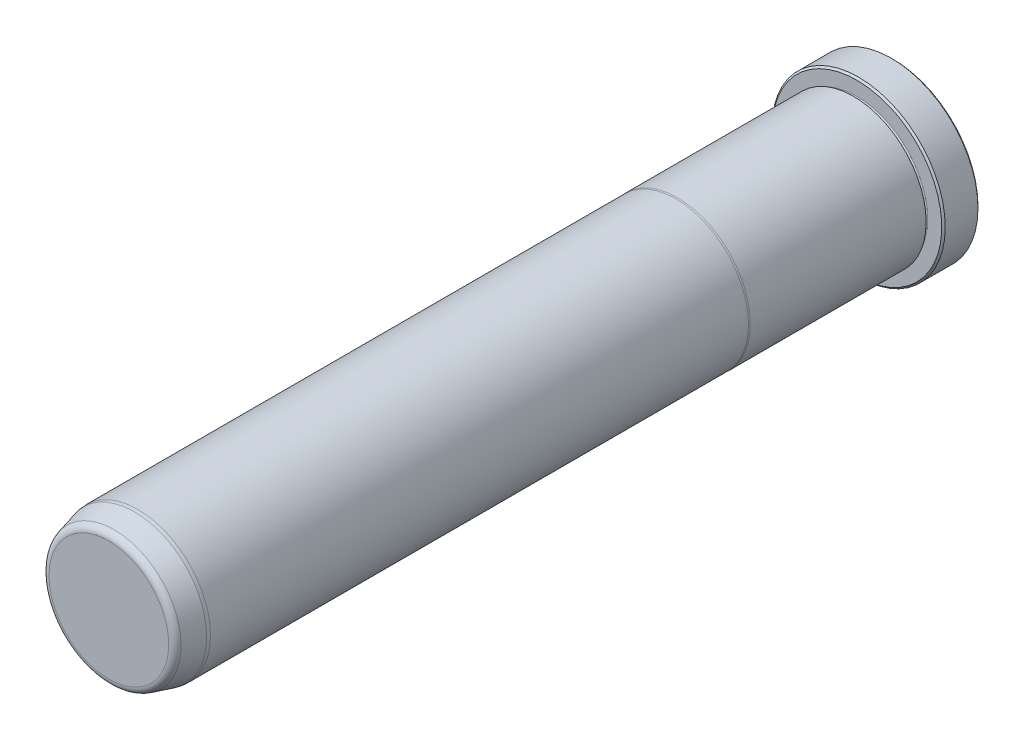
ISO-10303-21;
HEADER;
FILE_DESCRIPTION(('STEP AP214'),'2;1');
FILE_NAME('part.step','',(''),(''),'','','');
FILE_SCHEMA(('AUTOMOTIVE_DESIGN { 1 0 10303 214 1 1 1 1 }'));
ENDSEC;
DATA;
#1=APPLICATION_CONTEXT('core data for automotive mechanical design processes');
#2=APPLICATION_PROTOCOL_DEFINITION('international standard','automotive_design',2000,#1);
#3=PRODUCT_CONTEXT('',#1,'mechanical');
#4=PRODUCT('Part','Part','',(#3));
#5=PRODUCT_RELATED_PRODUCT_CATEGORY('part','',(#4));
#6=PRODUCT_DEFINITION_FORMATION('','',#4);
#7=PRODUCT_DEFINITION_CONTEXT('part definition',#1,'design');
#8=PRODUCT_DEFINITION('design','',#6,#7);
#9=PRODUCT_DEFINITION_SHAPE('','',#8);
#10=(LENGTH_UNIT() NAMED_UNIT(*) SI_UNIT(.MILLI.,.METRE.));
#11=(NAMED_UNIT(*) PLANE_ANGLE_UNIT() SI_UNIT($,.RADIAN.));
#12=(NAMED_UNIT(*) SI_UNIT($,.STERADIAN.) SOLID_ANGLE_UNIT());
#13=UNCERTAINTY_MEASURE_WITH_UNIT(LENGTH_MEASURE(1.E-05),#10,'distance_accuracy_value','');
#14=(GEOMETRIC_REPRESENTATION_CONTEXT(3) GLOBAL_UNCERTAINTY_ASSIGNED_CONTEXT((#13)) GLOBAL_UNIT_ASSIGNED_CONTEXT((#10,
#11,#12)) REPRESENTATION_CONTEXT('',''));
#15=CARTESIAN_POINT('',(0.,0.,0.));
#16=DIRECTION('',(0.,0.,1.));
#17=DIRECTION('',(1.,0.,0.));
#18=AXIS2_PLACEMENT_3D('',#15,#16,#17);
#19=CARTESIAN_POINT('',(0.,0.,0.));
#20=DIRECTION('',(0.,0.,1.));
#21=DIRECTION('',(1.,0.,0.));
#22=AXIS2_PLACEMENT_3D('',#19,#20,#21);
#23=PLANE('',#22);
#24=CARTESIAN_POINT('',(0.,0.,0.));
#25=DIRECTION('',(0.,0.,1.));
#26=DIRECTION('',(1.,0.,0.));
#27=AXIS2_PLACEMENT_3D('',#24,#25,#26);
#28=CIRCLE('',#27,18.542);
#29=CARTESIAN_POINT('',(18.542,0.,0.));
#30=VERTEX_POINT('',#29);
#31=EDGE_CURVE('E37',#30,#30,#28,.F.);
#32=ORIENTED_EDGE('',*,*,#31,.T.);
#33=EDGE_LOOP('',(#32));
#34=FACE_BOUND('',#33,.T.);
#35=ADVANCED_FACE('F30',(#34),#23,.F.);
#36=CARTESIAN_POINT('',(0.,0.,0.));
#37=DIRECTION('',(0.,0.,1.));
#38=DIRECTION('',(1.,0.,0.));
#39=AXIS2_PLACEMENT_3D('',#36,#37,#38);
#40=CYLINDRICAL_SURFACE('',#39,18.923);
#41=CARTESIAN_POINT('',(0.,0.,0.380999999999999));
#42=DIRECTION('',(0.,0.,1.));
#43=DIRECTION('',(1.,0.,0.));
#44=AXIS2_PLACEMENT_3D('',#41,#42,#43);
#45=CIRCLE('',#44,18.923);
#46=CARTESIAN_POINT('',(18.923,0.,0.380999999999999));
#47=VERTEX_POINT('',#46);
#48=EDGE_CURVE('E41',#47,#47,#45,.T.);
#49=ORIENTED_EDGE('',*,*,#48,.T.);
#50=EDGE_LOOP('',(#49));
#51=FACE_BOUND('',#50,.T.);
#52=CARTESIAN_POINT('',(0.,0.,7.54380000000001));
#53=DIRECTION('',(0.,0.,-1.));
#54=DIRECTION('',(-1.,0.,0.));
#55=AXIS2_PLACEMENT_3D('',#52,#53,#54);
#56=CIRCLE('',#55,18.923);
#57=CARTESIAN_POINT('',(-18.923,0.,7.54380000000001));
#58=VERTEX_POINT('',#57);
#59=EDGE_CURVE('E45',#58,#58,#56,.T.);
#60=ORIENTED_EDGE('',*,*,#59,.T.);
#61=EDGE_LOOP('',(#60));
#62=FACE_BOUND('',#61,.T.);
#63=ADVANCED_FACE('F118',(#51,#62),#40,.T.);
#64=CARTESIAN_POINT('',(0.,18.923,7.9248));
#65=DIRECTION('',(0.,0.,-1.));
#66=DIRECTION('',(-1.,0.,0.));
#67=AXIS2_PLACEMENT_3D('',#64,#65,#66);
#68=PLANE('',#67);
#69=CARTESIAN_POINT('',(0.,0.,7.9248));
#70=DIRECTION('',(0.,0.,-1.));
#71=DIRECTION('',(-1.,0.,0.));
#72=AXIS2_PLACEMENT_3D('',#69,#70,#71);
#73=CIRCLE('',#72,18.542);
#74=CARTESIAN_POINT('',(-18.542,0.,7.9248));
#75=VERTEX_POINT('',#74);
#76=EDGE_CURVE('E10',#75,#75,#73,.F.);
#77=ORIENTED_EDGE('',*,*,#76,.T.);
#78=EDGE_LOOP('',(#77));
#79=FACE_BOUND('',#78,.T.);
#80=CARTESIAN_POINT('',(0.,0.,7.9248));
#81=DIRECTION('',(0.,0.,1.));
#82=DIRECTION('',(1.,0.,0.));
#83=AXIS2_PLACEMENT_3D('',#80,#81,#82);
#84=CIRCLE('',#83,15.4813);
#85=CARTESIAN_POINT('',(15.4813,0.,7.9248));
#86=VERTEX_POINT('',#85);
#87=EDGE_CURVE('E56',#86,#86,#84,.T.);
#88=ORIENTED_EDGE('',*,*,#87,.F.);
#89=EDGE_LOOP('',(#88));
#90=FACE_BOUND('',#89,.T.);
#91=ADVANCED_FACE('F113',(#79,#90),#68,.F.);
#92=CARTESIAN_POINT('',(0.,0.,8.3058));
#93=DIRECTION('',(0.,0.,1.));
#94=DIRECTION('',(1.,0.,0.));
#95=AXIS2_PLACEMENT_3D('',#92,#93,#94);
#96=TOROIDAL_SURFACE('',#95,15.4813,0.381000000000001);
#97=CARTESIAN_POINT('',(0.,0.,8.6868));
#98=DIRECTION('',(0.,0.,1.));
#99=DIRECTION('',(1.,0.,0.));
#100=AXIS2_PLACEMENT_3D('',#97,#98,#99);
#101=CIRCLE('',#100,15.4813);
#102=CARTESIAN_POINT('',(15.4813,0.,8.6868));
#103=VERTEX_POINT('',#102);
#104=EDGE_CURVE('E59',#103,#103,#101,.T.);
#105=ORIENTED_EDGE('',*,*,#104,.F.);
#106=EDGE_LOOP('',(#105));
#107=FACE_BOUND('',#106,.T.);
#108=ORIENTED_EDGE('',*,*,#87,.T.);
#109=EDGE_LOOP('',(#108));
#110=FACE_BOUND('',#109,.T.);
#111=ADVANCED_FACE('F107',(#107,#110),#96,.F.);
#112=CARTESIAN_POINT('',(0.,15.4813,8.6868));
#113=DIRECTION('',(0.,0.,1.));
#114=DIRECTION('',(1.,0.,0.));
#115=AXIS2_PLACEMENT_3D('',#112,#113,#114);
#116=PLANE('',#115);
#117=CARTESIAN_POINT('',(0.,0.,8.6868));
#118=DIRECTION('',(0.,0.,1.));
#119=DIRECTION('',(1.,0.,0.));
#120=AXIS2_PLACEMENT_3D('',#117,#118,#119);
#121=CIRCLE('',#120,15.8877);
#122=CARTESIAN_POINT('',(15.8877,0.,8.6868));
#123=VERTEX_POINT('',#122);
#124=EDGE_CURVE('E62',#123,#123,#121,.T.);
#125=ORIENTED_EDGE('',*,*,#124,.F.);
#126=EDGE_LOOP('',(#125));
#127=FACE_BOUND('',#126,.T.);
#128=ORIENTED_EDGE('',*,*,#104,.T.);
#129=EDGE_LOOP('',(#128));
#130=FACE_BOUND('',#129,.T.);
#131=ADVANCED_FACE('F101',(#127,#130),#116,.F.);
#132=CARTESIAN_POINT('',(0.,0.,0.));
#133=DIRECTION('',(0.,0.,1.));
#134=DIRECTION('',(1.,0.,0.));
#135=AXIS2_PLACEMENT_3D('',#132,#133,#134);
#136=CYLINDRICAL_SURFACE('',#135,15.8877);
#137=CARTESIAN_POINT('',(0.,0.,47.1347630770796));
#138=DIRECTION('',(0.,0.,1.));
#139=DIRECTION('',(1.,0.,0.));
#140=AXIS2_PLACEMENT_3D('',#137,#138,#139);
#141=CIRCLE('',#140,15.8877);
#142=CARTESIAN_POINT('',(15.8877,0.,47.1347630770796));
#143=VERTEX_POINT('',#142);
#144=EDGE_CURVE('E65',#143,#143,#141,.T.);
#145=ORIENTED_EDGE('',*,*,#144,.F.);
#146=EDGE_LOOP('',(#145));
#147=FACE_BOUND('',#146,.T.);
#148=ORIENTED_EDGE('',*,*,#124,.T.);
#149=EDGE_LOOP('',(#148));
#150=FACE_BOUND('',#149,.T.);
#151=ADVANCED_FACE('F95',(#147,#150),#136,.T.);
#152=CARTESIAN_POINT('',(0.,0.,47.1347630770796));
#153=DIRECTION('',(0.,0.,-1.));
#154=DIRECTION('',(-1.,0.,0.));
#155=AXIS2_PLACEMENT_3D('',#152,#153,#154);
#156=CONICAL_SURFACE('',#155,15.8877,0.0698131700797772);
#157=CARTESIAN_POINT('',(0.,0.,47.498));
#158=DIRECTION('',(0.,0.,1.));
#159=DIRECTION('',(1.,0.,0.));
#160=AXIS2_PLACEMENT_3D('',#157,#158,#159);
#161=CIRCLE('',#160,15.8623);
#162=CARTESIAN_POINT('',(15.8623,0.,47.498));
#163=VERTEX_POINT('',#162);
#164=EDGE_CURVE('E68',#163,#163,#161,.T.);
#165=ORIENTED_EDGE('',*,*,#164,.F.);
#166=EDGE_LOOP('',(#165));
#167=FACE_BOUND('',#166,.T.);
#168=ORIENTED_EDGE('',*,*,#144,.T.);
#169=EDGE_LOOP('',(#168));
#170=FACE_BOUND('',#169,.T.);
#171=ADVANCED_FACE('F89',(#167,#170),#156,.T.);
#172=CARTESIAN_POINT('',(0.,0.,0.));
#173=DIRECTION('',(0.,0.,1.));
#174=DIRECTION('',(1.,0.,0.));
#175=AXIS2_PLACEMENT_3D('',#172,#173,#174);
#176=CYLINDRICAL_SURFACE('',#175,15.8623);
#177=CARTESIAN_POINT('',(0.,0.,165.1));
#178=DIRECTION('',(0.,0.,1.));
#179=DIRECTION('',(1.,0.,0.));
#180=AXIS2_PLACEMENT_3D('',#177,#178,#179);
#181=CIRCLE('',#180,15.8623);
#182=CARTESIAN_POINT('',(15.8623,0.,165.1));
#183=VERTEX_POINT('',#182);
#184=EDGE_CURVE('E71',#183,#183,#181,.T.);
#185=ORIENTED_EDGE('',*,*,#184,.F.);
#186=EDGE_LOOP('',(#185));
#187=FACE_BOUND('',#186,.T.);
#188=ORIENTED_EDGE('',*,*,#164,.T.);
#189=EDGE_LOOP('',(#188));
#190=FACE_BOUND('',#189,.T.);
#191=ADVANCED_FACE('F83',(#187,#190),#176,.T.);
#192=CARTESIAN_POINT('',(0.,0.,165.1));
#193=DIRECTION('',(0.,0.,-1.));
#194=DIRECTION('',(-1.,0.,0.));
#195=AXIS2_PLACEMENT_3D('',#192,#193,#194);
#196=CONICAL_SURFACE('',#195,15.8623,0.0872664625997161);
#197=CARTESIAN_POINT('',(0.,0.,165.862));
#198=DIRECTION('',(0.,0.,1.));
#199=DIRECTION('',(1.,0.,0.));
#200=AXIS2_PLACEMENT_3D('',#197,#198,#199);
#201=CIRCLE('',#200,15.7956336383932);
#202=CARTESIAN_POINT('',(15.7956336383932,0.,165.862));
#203=VERTEX_POINT('',#202);
#204=EDGE_CURVE('E74',#203,#203,#201,.T.);
#205=ORIENTED_EDGE('',*,*,#204,.F.);
#206=EDGE_LOOP('',(#205));
#207=FACE_BOUND('',#206,.T.);
#208=ORIENTED_EDGE('',*,*,#184,.T.);
#209=EDGE_LOOP('',(#208));
#210=FACE_BOUND('',#209,.T.);
#211=ADVANCED_FACE('F80',(#207,#210),#196,.T.);
#212=CARTESIAN_POINT('',(0.,0.,165.862));
#213=DIRECTION('',(0.,0.,-1.));
#214=DIRECTION('',(-1.,0.,0.));
#215=AXIS2_PLACEMENT_3D('',#212,#213,#214);
#216=CONICAL_SURFACE('',#215,15.7956336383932,0.26179938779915);
#217=CARTESIAN_POINT('',(0.,0.,170.2733752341));
#218=DIRECTION('',(0.,0.,1.));
#219=DIRECTION('',(1.,0.,0.));
#220=AXIS2_PLACEMENT_3D('',#217,#218,#219);
#221=CIRCLE('',#220,14.6136092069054);
#222=CARTESIAN_POINT('',(14.6136092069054,0.,170.2733752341));
#223=VERTEX_POINT('',#222);
#224=EDGE_CURVE('E50',#223,#223,#221,.F.);
#225=ORIENTED_EDGE('',*,*,#224,.T.);
#226=EDGE_LOOP('',(#225));
#227=FACE_BOUND('',#226,.T.);
#228=ORIENTED_EDGE('',*,*,#204,.T.);
#229=EDGE_LOOP('',(#228));
#230=FACE_BOUND('',#229,.T.);
#231=ADVANCED_FACE('F78',(#227,#230),#216,.T.);
#232=CARTESIAN_POINT('',(0.,14.2983335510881,171.45));
#233=DIRECTION('',(0.,0.,-1.));
#234=DIRECTION('',(-1.,0.,0.));
#235=AXIS2_PLACEMENT_3D('',#232,#233,#234);
#236=PLANE('',#235);
#237=CARTESIAN_POINT('',(0.,0.,171.45));
#238=DIRECTION('',(0.,0.,-1.));
#239=DIRECTION('',(-1.,0.,0.));
#240=AXIS2_PLACEMENT_3D('',#237,#238,#239);
#241=CIRCLE('',#240,13.0802019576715);
#242=CARTESIAN_POINT('',(-13.0802019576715,0.,171.45));
#243=VERTEX_POINT('',#242);
#244=EDGE_CURVE('E53',#243,#243,#241,.F.);
#245=ORIENTED_EDGE('',*,*,#244,.T.);
#246=EDGE_LOOP('',(#245));
#247=FACE_BOUND('',#246,.T.);
#248=ADVANCED_FACE('F133',(#247),#236,.F.);
#249=CARTESIAN_POINT('',(0.,0.,169.8625));
#250=DIRECTION('',(0.,0.,-1.));
#251=DIRECTION('',(-1.,0.,0.));
#252=AXIS2_PLACEMENT_3D('',#249,#250,#251);
#253=TOROIDAL_SURFACE('',#252,13.0802019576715,1.5875);
#254=ORIENTED_EDGE('',*,*,#224,.F.);
#255=EDGE_LOOP('',(#254));
#256=FACE_BOUND('',#255,.T.);
#257=ORIENTED_EDGE('',*,*,#244,.F.);
#258=EDGE_LOOP('',(#257));
#259=FACE_BOUND('',#258,.T.);
#260=ADVANCED_FACE('F130',(#256,#259),#253,.T.);
#261=CARTESIAN_POINT('',(0.,0.,0.380999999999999));
#262=DIRECTION('',(0.,0.,1.));
#263=DIRECTION('',(1.,0.,0.));
#264=AXIS2_PLACEMENT_3D('',#261,#262,#263);
#265=CONICAL_SURFACE('',#264,18.923,0.785398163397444);
#266=ORIENTED_EDGE('',*,*,#31,.F.);
#267=EDGE_LOOP('',(#266));
#268=FACE_BOUND('',#267,.T.);
#269=ORIENTED_EDGE('',*,*,#48,.F.);
#270=EDGE_LOOP('',(#269));
#271=FACE_BOUND('',#270,.T.);
#272=ADVANCED_FACE('F132',(#268,#271),#265,.T.);
#273=CARTESIAN_POINT('',(0.,0.,7.9248));
#274=DIRECTION('',(0.,0.,-1.));
#275=DIRECTION('',(-1.,0.,0.));
#276=AXIS2_PLACEMENT_3D('',#273,#274,#275);
#277=CONICAL_SURFACE('',#276,18.542,0.785398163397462);
#278=ORIENTED_EDGE('',*,*,#59,.F.);
#279=EDGE_LOOP('',(#278));
#280=FACE_BOUND('',#279,.T.);
#281=ORIENTED_EDGE('',*,*,#76,.F.);
#282=EDGE_LOOP('',(#281));
#283=FACE_BOUND('',#282,.T.);
#284=ADVANCED_FACE('F32',(#280,#283),#277,.T.);
#285=CLOSED_SHELL('',(#35,#63,#91,#111,#131,#151,#171,#191,#211,#231,#248,#260,#272,#284));
#286=MANIFOLD_SOLID_BREP('B2',#285);
#287=ADVANCED_BREP_SHAPE_REPRESENTATION('',(#18,#286),#14);
#288=SHAPE_DEFINITION_REPRESENTATION(#9,#287);
ENDSEC;
END-ISO-10303-21;
